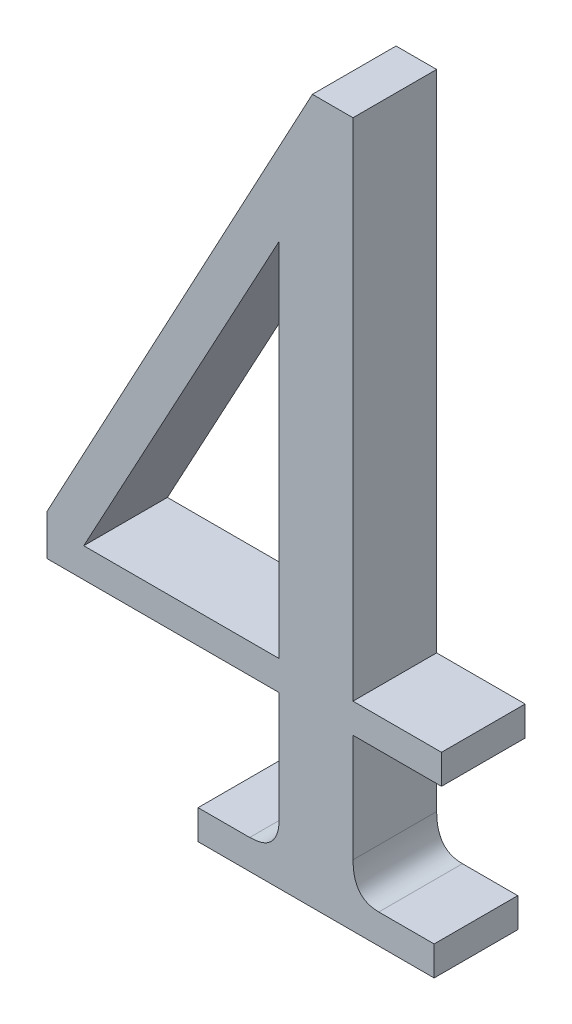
ISO-10303-21;
HEADER;
FILE_DESCRIPTION(('STEP AP214'),'2;1');
FILE_NAME('part.step','',(''),(''),'','','');
FILE_SCHEMA(('AUTOMOTIVE_DESIGN { 1 0 10303 214 1 1 1 1 }'));
ENDSEC;
DATA;
#1=APPLICATION_CONTEXT('core data for automotive mechanical design processes');
#2=APPLICATION_PROTOCOL_DEFINITION('international standard','automotive_design',2000,#1);
#3=PRODUCT_CONTEXT('',#1,'mechanical');
#4=PRODUCT('Part','Part','',(#3));
#5=PRODUCT_RELATED_PRODUCT_CATEGORY('part','',(#4));
#6=PRODUCT_DEFINITION_FORMATION('','',#4);
#7=PRODUCT_DEFINITION_CONTEXT('part definition',#1,'design');
#8=PRODUCT_DEFINITION('design','',#6,#7);
#9=PRODUCT_DEFINITION_SHAPE('','',#8);
#10=(LENGTH_UNIT() NAMED_UNIT(*) SI_UNIT(.MILLI.,.METRE.));
#11=(NAMED_UNIT(*) PLANE_ANGLE_UNIT() SI_UNIT($,.RADIAN.));
#12=(NAMED_UNIT(*) SI_UNIT($,.STERADIAN.) SOLID_ANGLE_UNIT());
#13=UNCERTAINTY_MEASURE_WITH_UNIT(LENGTH_MEASURE(1.E-05),#10,'distance_accuracy_value','');
#14=(GEOMETRIC_REPRESENTATION_CONTEXT(3) GLOBAL_UNCERTAINTY_ASSIGNED_CONTEXT((#13)) GLOBAL_UNIT_ASSIGNED_CONTEXT((#10,
#11,#12)) REPRESENTATION_CONTEXT('',''));
#15=CARTESIAN_POINT('',(0.,0.,0.));
#16=DIRECTION('',(0.,0.,1.));
#17=DIRECTION('',(1.,0.,0.));
#18=AXIS2_PLACEMENT_3D('',#15,#16,#17);
#19=CARTESIAN_POINT('',(12.4929833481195,0.0788718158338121,3.));
#20=DIRECTION('',(0.,0.,-1.));
#21=DIRECTION('',(-1.,0.,0.));
#22=AXIS2_PLACEMENT_3D('',#19,#20,#21);
#23=PLANE('',#22);
#24=DIRECTION('',(0.473315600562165,0.880892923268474,0.));
#25=VECTOR('',#24,1.);
#26=CARTESIAN_POINT('',(1.32275132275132,6.21693121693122,3.));
#27=LINE('',#26,#25);
#28=CARTESIAN_POINT('',(1.32275132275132,6.21693121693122,3.));
#29=VERTEX_POINT('',#28);
#30=CARTESIAN_POINT('',(10.8465608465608,23.9417989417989,3.));
#31=VERTEX_POINT('',#30);
#32=EDGE_CURVE('E214',#29,#31,#27,.T.);
#33=ORIENTED_EDGE('',*,*,#32,.F.);
#34=DIRECTION('',(0.,1.,0.));
#35=VECTOR('',#34,1.);
#36=CARTESIAN_POINT('',(1.32275132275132,4.76190476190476,3.));
#37=LINE('',#36,#35);
#38=CARTESIAN_POINT('',(1.32275132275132,4.76190476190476,3.));
#39=VERTEX_POINT('',#38);
#40=EDGE_CURVE('E342',#39,#29,#37,.T.);
#41=ORIENTED_EDGE('',*,*,#40,.F.);
#42=DIRECTION('',(-1.,0.,0.));
#43=VECTOR('',#42,1.);
#44=CARTESIAN_POINT('',(9.65608465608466,4.76190476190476,3.));
#45=LINE('',#44,#43);
#46=CARTESIAN_POINT('',(9.65608465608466,4.76190476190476,3.));
#47=VERTEX_POINT('',#46);
#48=EDGE_CURVE('E338',#47,#39,#45,.T.);
#49=ORIENTED_EDGE('',*,*,#48,.F.);
#50=DIRECTION('',(0.,1.,0.));
#51=VECTOR('',#50,1.);
#52=CARTESIAN_POINT('',(9.65608465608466,0.891632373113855,3.));
#53=LINE('',#52,#51);
#54=CARTESIAN_POINT('',(9.65608465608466,0.891632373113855,3.));
#55=VERTEX_POINT('',#54);
#56=EDGE_CURVE('E329',#55,#47,#53,.T.);
#57=ORIENTED_EDGE('',*,*,#56,.F.);
#58=CARTESIAN_POINT('',(8.5978835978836,-0.264550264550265,3.));
#59=CARTESIAN_POINT('',(8.68153222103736,-0.260950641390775,3.));
#60=CARTESIAN_POINT('',(8.83934158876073,-0.254159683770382,3.));
#61=CARTESIAN_POINT('',(9.05888298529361,-0.199812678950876,3.));
#62=CARTESIAN_POINT('',(9.24795517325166,-0.112378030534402,3.));
#63=CARTESIAN_POINT('',(9.39790454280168,0.021250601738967,3.));
#64=CARTESIAN_POINT('',(9.51990175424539,0.186883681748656,3.));
#65=CARTESIAN_POINT('',(9.60093788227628,0.392565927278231,3.));
#66=CARTESIAN_POINT('',(9.65020189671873,0.631258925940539,3.));
#67=CARTESIAN_POINT('',(9.6540491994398,0.801542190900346,3.));
#68=CARTESIAN_POINT('',(9.65608465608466,0.891632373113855,3.));
#69=B_SPLINE_CURVE_WITH_KNOTS('',3,(#58,#59,#60,#61,#62,#63,#64,#65,#66,#67,#68),.UNSPECIFIED.,
.F.,.F.,(4,1,1,1,1,1,1,1,4),(0.,0.139521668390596,0.263218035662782,0.375437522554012,
0.483709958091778,0.594997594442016,0.716049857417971,0.84977314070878,1.),.UNSPECIFIED.);
#70=CARTESIAN_POINT('',(8.5978835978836,-0.264550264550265,3.));
#71=VERTEX_POINT('',#70);
#72=EDGE_CURVE('E321',#71,#55,#69,.T.);
#73=ORIENTED_EDGE('',*,*,#72,.F.);
#74=DIRECTION('',(1.,0.,0.));
#75=VECTOR('',#74,1.);
#76=CARTESIAN_POINT('',(6.74603174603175,-0.264550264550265,3.));
#77=LINE('',#76,#75);
#78=CARTESIAN_POINT('',(6.74603174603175,-0.264550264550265,3.));
#79=VERTEX_POINT('',#78);
#80=EDGE_CURVE('E330',#79,#71,#77,.T.);
#81=ORIENTED_EDGE('',*,*,#80,.F.);
#82=DIRECTION('',(0.,1.,0.));
#83=VECTOR('',#82,1.);
#84=CARTESIAN_POINT('',(6.74603174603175,-1.32275132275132,3.));
#85=LINE('',#84,#83);
#86=CARTESIAN_POINT('',(6.74603174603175,-1.32275132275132,3.));
#87=VERTEX_POINT('',#86);
#88=EDGE_CURVE('E514',#87,#79,#85,.T.);
#89=ORIENTED_EDGE('',*,*,#88,.F.);
#90=DIRECTION('',(-1.,0.,0.));
#91=VECTOR('',#90,1.);
#92=CARTESIAN_POINT('',(15.2116402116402,-1.32275132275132,3.));
#93=LINE('',#92,#91);
#94=CARTESIAN_POINT('',(15.2116402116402,-1.32275132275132,3.));
#95=VERTEX_POINT('',#94);
#96=EDGE_CURVE('E501',#95,#87,#93,.T.);
#97=ORIENTED_EDGE('',*,*,#96,.F.);
#98=DIRECTION('',(0.,-1.,0.));
#99=VECTOR('',#98,1.);
#100=CARTESIAN_POINT('',(15.2116402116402,-0.264550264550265,3.));
#101=LINE('',#100,#99);
#102=CARTESIAN_POINT('',(15.2116402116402,-0.264550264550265,3.));
#103=VERTEX_POINT('',#102);
#104=EDGE_CURVE('E495',#103,#95,#101,.T.);
#105=ORIENTED_EDGE('',*,*,#104,.F.);
#106=DIRECTION('',(1.,0.,0.));
#107=VECTOR('',#106,1.);
#108=CARTESIAN_POINT('',(13.2275132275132,-0.264550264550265,3.));
#109=LINE('',#108,#107);
#110=CARTESIAN_POINT('',(13.2275132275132,-0.264550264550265,3.));
#111=VERTEX_POINT('',#110);
#112=EDGE_CURVE('E250',#111,#103,#109,.T.);
#113=ORIENTED_EDGE('',*,*,#112,.F.);
#114=CARTESIAN_POINT('',(12.3015873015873,0.891632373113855,3.));
#115=CARTESIAN_POINT('',(12.304057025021,0.801626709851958,3.));
#116=CARTESIAN_POINT('',(12.3087164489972,0.63182043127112,3.));
#117=CARTESIAN_POINT('',(12.3521720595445,0.393544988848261,3.));
#118=CARTESIAN_POINT('',(12.4247251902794,0.191273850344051,3.));
#119=CARTESIAN_POINT('',(12.5237023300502,0.0205479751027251,3.));
#120=CARTESIAN_POINT('',(12.6585932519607,-0.108459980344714,3.));
#121=CARTESIAN_POINT('',(12.8237090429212,-0.200554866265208,3.));
#122=CARTESIAN_POINT('',(13.0169657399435,-0.253258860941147,3.));
#123=CARTESIAN_POINT('',(13.1553378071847,-0.260679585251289,3.));
#124=CARTESIAN_POINT('',(13.2275132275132,-0.264550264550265,3.));
#125=B_SPLINE_CURVE_WITH_KNOTS('',3,(#114,#115,#116,#117,#118,#119,#120,#121,#122,#123,#124),
.UNSPECIFIED.,.F.,.F.,(4,1,1,1,1,1,1,1,4),(0.,0.159627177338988,0.301155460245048,
0.427675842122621,0.539502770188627,0.648129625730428,0.75453020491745,0.871961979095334,1.),.UNSPECIFIED.);
#126=CARTESIAN_POINT('',(12.3015873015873,0.891632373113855,3.));
#127=VERTEX_POINT('',#126);
#128=EDGE_CURVE('E243',#127,#111,#125,.T.);
#129=ORIENTED_EDGE('',*,*,#128,.F.);
#130=DIRECTION('',(0.,-1.,0.));
#131=VECTOR('',#130,1.);
#132=CARTESIAN_POINT('',(12.3015873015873,4.76190476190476,3.));
#133=LINE('',#132,#131);
#134=CARTESIAN_POINT('',(12.3015873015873,4.76190476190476,3.));
#135=VERTEX_POINT('',#134);
#136=EDGE_CURVE('E239',#135,#127,#133,.T.);
#137=ORIENTED_EDGE('',*,*,#136,.F.);
#138=DIRECTION('',(-1.,0.,0.));
#139=VECTOR('',#138,1.);
#140=CARTESIAN_POINT('',(15.4761904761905,4.76190476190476,3.));
#141=LINE('',#140,#139);
#142=CARTESIAN_POINT('',(15.4761904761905,4.76190476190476,3.));
#143=VERTEX_POINT('',#142);
#144=EDGE_CURVE('E235',#143,#135,#141,.T.);
#145=ORIENTED_EDGE('',*,*,#144,.F.);
#146=DIRECTION('',(0.,-1.,0.));
#147=VECTOR('',#146,1.);
#148=CARTESIAN_POINT('',(15.4761904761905,5.82010582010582,3.));
#149=LINE('',#148,#147);
#150=CARTESIAN_POINT('',(15.4761904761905,5.82010582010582,3.));
#151=VERTEX_POINT('',#150);
#152=EDGE_CURVE('E231',#151,#143,#149,.T.);
#153=ORIENTED_EDGE('',*,*,#152,.F.);
#154=DIRECTION('',(1.,0.,0.));
#155=VECTOR('',#154,1.);
#156=CARTESIAN_POINT('',(12.3015873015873,5.82010582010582,3.));
#157=LINE('',#156,#155);
#158=CARTESIAN_POINT('',(12.3015873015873,5.82010582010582,3.));
#159=VERTEX_POINT('',#158);
#160=EDGE_CURVE('E227',#159,#151,#157,.T.);
#161=ORIENTED_EDGE('',*,*,#160,.F.);
#162=DIRECTION('',(0.,-1.,0.));
#163=VECTOR('',#162,1.);
#164=CARTESIAN_POINT('',(12.3015873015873,23.9417989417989,3.));
#165=LINE('',#164,#163);
#166=CARTESIAN_POINT('',(12.3015873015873,23.9417989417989,3.));
#167=VERTEX_POINT('',#166);
#168=EDGE_CURVE('E223',#167,#159,#165,.T.);
#169=ORIENTED_EDGE('',*,*,#168,.F.);
#170=DIRECTION('',(1.,0.,0.));
#171=VECTOR('',#170,1.);
#172=CARTESIAN_POINT('',(10.8465608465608,23.9417989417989,3.));
#173=LINE('',#172,#171);
#174=EDGE_CURVE('E218',#31,#167,#173,.T.);
#175=ORIENTED_EDGE('',*,*,#174,.F.);
#176=EDGE_LOOP('',(#33,#41,#49,#57,#73,#81,#89,#97,#105,#113,#129,#137,#145,#153,#161,#169,#175));
#177=FACE_BOUND('',#176,.T.);
#178=DIRECTION('',(1.,0.,0.));
#179=VECTOR('',#178,1.);
#180=CARTESIAN_POINT('',(2.64550264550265,5.82010582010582,3.));
#181=LINE('',#180,#179);
#182=CARTESIAN_POINT('',(2.64550264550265,5.82010582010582,3.));
#183=VERTEX_POINT('',#182);
#184=CARTESIAN_POINT('',(9.65608465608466,5.82010582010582,3.));
#185=VERTEX_POINT('',#184);
#186=EDGE_CURVE('E178',#183,#185,#181,.T.);
#187=ORIENTED_EDGE('',*,*,#186,.F.);
#188=DIRECTION('',(-0.475704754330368,-0.879605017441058,0.));
#189=VECTOR('',#188,1.);
#190=CARTESIAN_POINT('',(9.65608465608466,18.7830687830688,3.));
#191=LINE('',#190,#189);
#192=CARTESIAN_POINT('',(9.65608465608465,18.7830687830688,3.));
#193=VERTEX_POINT('',#192);
#194=EDGE_CURVE('E197',#193,#183,#191,.T.);
#195=ORIENTED_EDGE('',*,*,#194,.F.);
#196=DIRECTION('',(0.,1.,0.));
#197=VECTOR('',#196,1.);
#198=CARTESIAN_POINT('',(9.65608465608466,5.82010582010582,3.));
#199=LINE('',#198,#197);
#200=EDGE_CURVE('E187',#185,#193,#199,.T.);
#201=ORIENTED_EDGE('',*,*,#200,.F.);
#202=EDGE_LOOP('',(#187,#195,#201));
#203=FACE_BOUND('',#202,.T.);
#204=ADVANCED_FACE('F39',(#177,#203),#23,.F.);
#205=CARTESIAN_POINT('',(12.4929833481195,0.0788718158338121,0.));
#206=DIRECTION('',(0.,0.,-1.));
#207=DIRECTION('',(-1.,0.,0.));
#208=AXIS2_PLACEMENT_3D('',#205,#206,#207);
#209=PLANE('',#208);
#210=DIRECTION('',(0.473315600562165,0.880892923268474,0.));
#211=VECTOR('',#210,1.);
#212=CARTESIAN_POINT('',(1.32275132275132,6.21693121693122,0.));
#213=LINE('',#212,#211);
#214=CARTESIAN_POINT('',(1.32275132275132,6.21693121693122,0.));
#215=VERTEX_POINT('',#214);
#216=CARTESIAN_POINT('',(10.8465608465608,23.9417989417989,0.));
#217=VERTEX_POINT('',#216);
#218=EDGE_CURVE('E195',#215,#217,#213,.T.);
#219=ORIENTED_EDGE('',*,*,#218,.T.);
#220=DIRECTION('',(1.,0.,0.));
#221=VECTOR('',#220,1.);
#222=CARTESIAN_POINT('',(10.8465608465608,23.9417989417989,0.));
#223=LINE('',#222,#221);
#224=CARTESIAN_POINT('',(12.3015873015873,23.9417989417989,0.));
#225=VERTEX_POINT('',#224);
#226=EDGE_CURVE('E349',#217,#225,#223,.T.);
#227=ORIENTED_EDGE('',*,*,#226,.T.);
#228=DIRECTION('',(0.,-1.,0.));
#229=VECTOR('',#228,1.);
#230=CARTESIAN_POINT('',(12.3015873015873,23.9417989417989,0.));
#231=LINE('',#230,#229);
#232=CARTESIAN_POINT('',(12.3015873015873,5.82010582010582,0.));
#233=VERTEX_POINT('',#232);
#234=EDGE_CURVE('E353',#225,#233,#231,.T.);
#235=ORIENTED_EDGE('',*,*,#234,.T.);
#236=DIRECTION('',(1.,0.,0.));
#237=VECTOR('',#236,1.);
#238=CARTESIAN_POINT('',(12.3015873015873,5.82010582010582,0.));
#239=LINE('',#238,#237);
#240=CARTESIAN_POINT('',(15.4761904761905,5.82010582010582,0.));
#241=VERTEX_POINT('',#240);
#242=EDGE_CURVE('E357',#233,#241,#239,.T.);
#243=ORIENTED_EDGE('',*,*,#242,.T.);
#244=DIRECTION('',(0.,-1.,0.));
#245=VECTOR('',#244,1.);
#246=CARTESIAN_POINT('',(15.4761904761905,5.82010582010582,0.));
#247=LINE('',#246,#245);
#248=CARTESIAN_POINT('',(15.4761904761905,4.76190476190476,0.));
#249=VERTEX_POINT('',#248);
#250=EDGE_CURVE('E361',#241,#249,#247,.T.);
#251=ORIENTED_EDGE('',*,*,#250,.T.);
#252=DIRECTION('',(-1.,0.,0.));
#253=VECTOR('',#252,1.);
#254=CARTESIAN_POINT('',(15.4761904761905,4.76190476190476,0.));
#255=LINE('',#254,#253);
#256=CARTESIAN_POINT('',(12.3015873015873,4.76190476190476,0.));
#257=VERTEX_POINT('',#256);
#258=EDGE_CURVE('E365',#249,#257,#255,.T.);
#259=ORIENTED_EDGE('',*,*,#258,.T.);
#260=DIRECTION('',(0.,-1.,0.));
#261=VECTOR('',#260,1.);
#262=CARTESIAN_POINT('',(12.3015873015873,4.76190476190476,0.));
#263=LINE('',#262,#261);
#264=CARTESIAN_POINT('',(12.3015873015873,0.891632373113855,0.));
#265=VERTEX_POINT('',#264);
#266=EDGE_CURVE('E369',#257,#265,#263,.T.);
#267=ORIENTED_EDGE('',*,*,#266,.T.);
#268=CARTESIAN_POINT('',(12.3015873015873,0.891632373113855,0.));
#269=CARTESIAN_POINT('',(12.304057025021,0.801626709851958,0.));
#270=CARTESIAN_POINT('',(12.3087164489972,0.63182043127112,0.));
#271=CARTESIAN_POINT('',(12.3521720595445,0.393544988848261,0.));
#272=CARTESIAN_POINT('',(12.4247251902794,0.191273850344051,0.));
#273=CARTESIAN_POINT('',(12.5237023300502,0.0205479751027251,0.));
#274=CARTESIAN_POINT('',(12.6585932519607,-0.108459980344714,0.));
#275=CARTESIAN_POINT('',(12.8237090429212,-0.200554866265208,0.));
#276=CARTESIAN_POINT('',(13.0169657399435,-0.253258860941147,0.));
#277=CARTESIAN_POINT('',(13.1553378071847,-0.260679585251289,0.));
#278=CARTESIAN_POINT('',(13.2275132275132,-0.264550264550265,0.));
#279=B_SPLINE_CURVE_WITH_KNOTS('',3,(#268,#269,#270,#271,#272,#273,#274,#275,#276,#277,#278),
.UNSPECIFIED.,.F.,.F.,(4,1,1,1,1,1,1,1,4),(0.,0.159627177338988,0.301155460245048,
0.427675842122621,0.539502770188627,0.648129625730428,0.75453020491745,0.871961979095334,1.),.UNSPECIFIED.);
#280=CARTESIAN_POINT('',(13.2275132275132,-0.264550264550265,0.));
#281=VERTEX_POINT('',#280);
#282=EDGE_CURVE('E373',#265,#281,#279,.T.);
#283=ORIENTED_EDGE('',*,*,#282,.T.);
#284=DIRECTION('',(1.,0.,0.));
#285=VECTOR('',#284,1.);
#286=CARTESIAN_POINT('',(13.2275132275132,-0.264550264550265,0.));
#287=LINE('',#286,#285);
#288=CARTESIAN_POINT('',(15.2116402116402,-0.264550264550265,0.));
#289=VERTEX_POINT('',#288);
#290=EDGE_CURVE('E379',#281,#289,#287,.T.);
#291=ORIENTED_EDGE('',*,*,#290,.T.);
#292=DIRECTION('',(0.,-1.,0.));
#293=VECTOR('',#292,1.);
#294=CARTESIAN_POINT('',(15.2116402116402,-0.264550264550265,0.));
#295=LINE('',#294,#293);
#296=CARTESIAN_POINT('',(15.2116402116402,-1.32275132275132,0.));
#297=VERTEX_POINT('',#296);
#298=EDGE_CURVE('E386',#289,#297,#295,.T.);
#299=ORIENTED_EDGE('',*,*,#298,.T.);
#300=DIRECTION('',(-1.,0.,0.));
#301=VECTOR('',#300,1.);
#302=CARTESIAN_POINT('',(15.2116402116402,-1.32275132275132,0.));
#303=LINE('',#302,#301);
#304=CARTESIAN_POINT('',(6.74603174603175,-1.32275132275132,0.));
#305=VERTEX_POINT('',#304);
#306=EDGE_CURVE('E390',#297,#305,#303,.T.);
#307=ORIENTED_EDGE('',*,*,#306,.T.);
#308=DIRECTION('',(0.,1.,0.));
#309=VECTOR('',#308,1.);
#310=CARTESIAN_POINT('',(6.74603174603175,-1.32275132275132,0.));
#311=LINE('',#310,#309);
#312=CARTESIAN_POINT('',(6.74603174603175,-0.264550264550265,0.));
#313=VERTEX_POINT('',#312);
#314=EDGE_CURVE('E394',#305,#313,#311,.T.);
#315=ORIENTED_EDGE('',*,*,#314,.T.);
#316=DIRECTION('',(1.,0.,0.));
#317=VECTOR('',#316,1.);
#318=CARTESIAN_POINT('',(6.74603174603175,-0.264550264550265,0.));
#319=LINE('',#318,#317);
#320=CARTESIAN_POINT('',(8.5978835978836,-0.264550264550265,0.));
#321=VERTEX_POINT('',#320);
#322=EDGE_CURVE('E398',#313,#321,#319,.T.);
#323=ORIENTED_EDGE('',*,*,#322,.T.);
#324=CARTESIAN_POINT('',(8.5978835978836,-0.264550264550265,0.));
#325=CARTESIAN_POINT('',(8.68153222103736,-0.260950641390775,0.));
#326=CARTESIAN_POINT('',(8.83934158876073,-0.254159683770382,0.));
#327=CARTESIAN_POINT('',(9.05888298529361,-0.199812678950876,0.));
#328=CARTESIAN_POINT('',(9.24795517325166,-0.112378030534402,0.));
#329=CARTESIAN_POINT('',(9.39790454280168,0.021250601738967,0.));
#330=CARTESIAN_POINT('',(9.51990175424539,0.186883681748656,0.));
#331=CARTESIAN_POINT('',(9.60093788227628,0.392565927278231,0.));
#332=CARTESIAN_POINT('',(9.65020189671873,0.631258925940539,0.));
#333=CARTESIAN_POINT('',(9.6540491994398,0.801542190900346,0.));
#334=CARTESIAN_POINT('',(9.65608465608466,0.891632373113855,0.));
#335=B_SPLINE_CURVE_WITH_KNOTS('',3,(#324,#325,#326,#327,#328,#329,#330,#331,#332,#333,#334),
.UNSPECIFIED.,.F.,.F.,(4,1,1,1,1,1,1,1,4),(0.,0.139521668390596,0.263218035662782,
0.375437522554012,0.483709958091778,0.594997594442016,0.716049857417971,0.84977314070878,1.),.UNSPECIFIED.);
#336=CARTESIAN_POINT('',(9.65608465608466,0.891632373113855,0.));
#337=VERTEX_POINT('',#336);
#338=EDGE_CURVE('E402',#321,#337,#335,.T.);
#339=ORIENTED_EDGE('',*,*,#338,.T.);
#340=DIRECTION('',(0.,1.,0.));
#341=VECTOR('',#340,1.);
#342=CARTESIAN_POINT('',(9.65608465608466,0.891632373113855,0.));
#343=LINE('',#342,#341);
#344=CARTESIAN_POINT('',(9.65608465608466,4.76190476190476,0.));
#345=VERTEX_POINT('',#344);
#346=EDGE_CURVE('E408',#337,#345,#343,.T.);
#347=ORIENTED_EDGE('',*,*,#346,.T.);
#348=DIRECTION('',(-1.,0.,0.));
#349=VECTOR('',#348,1.);
#350=CARTESIAN_POINT('',(9.65608465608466,4.76190476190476,0.));
#351=LINE('',#350,#349);
#352=CARTESIAN_POINT('',(1.32275132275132,4.76190476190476,0.));
#353=VERTEX_POINT('',#352);
#354=EDGE_CURVE('E415',#345,#353,#351,.T.);
#355=ORIENTED_EDGE('',*,*,#354,.T.);
#356=DIRECTION('',(0.,1.,0.));
#357=VECTOR('',#356,1.);
#358=CARTESIAN_POINT('',(1.32275132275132,4.76190476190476,0.));
#359=LINE('',#358,#357);
#360=EDGE_CURVE('E219',#353,#215,#359,.T.);
#361=ORIENTED_EDGE('',*,*,#360,.T.);
#362=EDGE_LOOP('',(#219,#227,#235,#243,#251,#259,#267,#283,#291,#299,#307,#315,#323,#339,#347,
#355,#361));
#363=FACE_BOUND('',#362,.T.);
#364=DIRECTION('',(-0.475704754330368,-0.879605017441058,0.));
#365=VECTOR('',#364,1.);
#366=CARTESIAN_POINT('',(9.65608465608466,18.7830687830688,0.));
#367=LINE('',#366,#365);
#368=CARTESIAN_POINT('',(9.65608465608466,18.7830687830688,0.));
#369=VERTEX_POINT('',#368);
#370=CARTESIAN_POINT('',(2.64550264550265,5.82010582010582,0.));
#371=VERTEX_POINT('',#370);
#372=EDGE_CURVE('E188',#369,#371,#367,.T.);
#373=ORIENTED_EDGE('',*,*,#372,.T.);
#374=DIRECTION('',(1.,0.,0.));
#375=VECTOR('',#374,1.);
#376=CARTESIAN_POINT('',(2.64550264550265,5.82010582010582,0.));
#377=LINE('',#376,#375);
#378=CARTESIAN_POINT('',(9.65608465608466,5.82010582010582,0.));
#379=VERTEX_POINT('',#378);
#380=EDGE_CURVE('E65',#371,#379,#377,.T.);
#381=ORIENTED_EDGE('',*,*,#380,.T.);
#382=DIRECTION('',(0.,1.,0.));
#383=VECTOR('',#382,1.);
#384=CARTESIAN_POINT('',(9.65608465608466,5.82010582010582,0.));
#385=LINE('',#384,#383);
#386=EDGE_CURVE('E193',#379,#369,#385,.T.);
#387=ORIENTED_EDGE('',*,*,#386,.T.);
#388=EDGE_LOOP('',(#373,#381,#387));
#389=FACE_BOUND('',#388,.T.);
#390=ADVANCED_FACE('F291',(#363,#389),#209,.T.);
#391=CARTESIAN_POINT('',(1.32275132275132,6.21693121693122,3.));
#392=DIRECTION('',(-0.880892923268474,0.473315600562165,0.));
#393=DIRECTION('',(-0.473315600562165,-0.880892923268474,0.));
#394=AXIS2_PLACEMENT_3D('',#391,#392,#393);
#395=PLANE('',#394);
#396=ORIENTED_EDGE('',*,*,#218,.F.);
#397=DIRECTION('',(0.,0.,-1.));
#398=VECTOR('',#397,1.);
#399=CARTESIAN_POINT('',(1.32275132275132,6.21693121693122,3.));
#400=LINE('',#399,#398);
#401=EDGE_CURVE('E11',#29,#215,#400,.T.);
#402=ORIENTED_EDGE('',*,*,#401,.F.);
#403=ORIENTED_EDGE('',*,*,#32,.T.);
#404=DIRECTION('',(0.,0.,-1.));
#405=VECTOR('',#404,1.);
#406=CARTESIAN_POINT('',(10.8465608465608,23.9417989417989,3.));
#407=LINE('',#406,#405);
#408=EDGE_CURVE('E43',#31,#217,#407,.T.);
#409=ORIENTED_EDGE('',*,*,#408,.T.);
#410=EDGE_LOOP('',(#396,#402,#403,#409));
#411=FACE_BOUND('',#410,.T.);
#412=ADVANCED_FACE('F41',(#411),#395,.T.);
#413=CARTESIAN_POINT('',(1.32275132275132,4.76190476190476,3.));
#414=DIRECTION('',(-1.,0.,0.));
#415=DIRECTION('',(0.,0.,1.));
#416=AXIS2_PLACEMENT_3D('',#413,#414,#415);
#417=PLANE('',#416);
#418=ORIENTED_EDGE('',*,*,#360,.F.);
#419=DIRECTION('',(0.,0.,-1.));
#420=VECTOR('',#419,1.);
#421=CARTESIAN_POINT('',(1.32275132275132,4.76190476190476,3.));
#422=LINE('',#421,#420);
#423=EDGE_CURVE('E49',#39,#353,#422,.T.);
#424=ORIENTED_EDGE('',*,*,#423,.F.);
#425=ORIENTED_EDGE('',*,*,#40,.T.);
#426=ORIENTED_EDGE('',*,*,#401,.T.);
#427=EDGE_LOOP('',(#418,#424,#425,#426));
#428=FACE_BOUND('',#427,.T.);
#429=ADVANCED_FACE('F302',(#428),#417,.T.);
#430=CARTESIAN_POINT('',(9.65608465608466,4.76190476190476,3.));
#431=DIRECTION('',(0.,-1.,0.));
#432=DIRECTION('',(0.,0.,-1.));
#433=AXIS2_PLACEMENT_3D('',#430,#431,#432);
#434=PLANE('',#433);
#435=ORIENTED_EDGE('',*,*,#354,.F.);
#436=DIRECTION('',(0.,0.,-1.));
#437=VECTOR('',#436,1.);
#438=CARTESIAN_POINT('',(9.65608465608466,4.76190476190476,3.));
#439=LINE('',#438,#437);
#440=EDGE_CURVE('E424',#47,#345,#439,.T.);
#441=ORIENTED_EDGE('',*,*,#440,.F.);
#442=ORIENTED_EDGE('',*,*,#48,.T.);
#443=ORIENTED_EDGE('',*,*,#423,.T.);
#444=EDGE_LOOP('',(#435,#441,#442,#443));
#445=FACE_BOUND('',#444,.T.);
#446=ADVANCED_FACE('F305',(#445),#434,.T.);
#447=CARTESIAN_POINT('',(9.65608465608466,0.891632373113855,3.));
#448=DIRECTION('',(-1.,0.,0.));
#449=DIRECTION('',(0.,0.,1.));
#450=AXIS2_PLACEMENT_3D('',#447,#448,#449);
#451=PLANE('',#450);
#452=ORIENTED_EDGE('',*,*,#346,.F.);
#453=DIRECTION('',(0.,0.,-1.));
#454=VECTOR('',#453,1.);
#455=CARTESIAN_POINT('',(9.65608465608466,0.891632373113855,3.));
#456=LINE('',#455,#454);
#457=EDGE_CURVE('E427',#55,#337,#456,.T.);
#458=ORIENTED_EDGE('',*,*,#457,.F.);
#459=ORIENTED_EDGE('',*,*,#56,.T.);
#460=ORIENTED_EDGE('',*,*,#440,.T.);
#461=EDGE_LOOP('',(#452,#458,#459,#460));
#462=FACE_BOUND('',#461,.T.);
#463=ADVANCED_FACE('F309',(#462),#451,.T.);
#464=DIRECTION('',(0.,0.,-1.));
#465=VECTOR('',#464,1.);
#466=SURFACE_OF_LINEAR_EXTRUSION('',#69,#465);
#467=ORIENTED_EDGE('',*,*,#338,.F.);
#468=DIRECTION('',(0.,0.,-1.));
#469=VECTOR('',#468,1.);
#470=CARTESIAN_POINT('',(8.5978835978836,-0.264550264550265,3.));
#471=LINE('',#470,#469);
#472=EDGE_CURVE('E430',#71,#321,#471,.T.);
#473=ORIENTED_EDGE('',*,*,#472,.F.);
#474=ORIENTED_EDGE('',*,*,#72,.T.);
#475=ORIENTED_EDGE('',*,*,#457,.T.);
#476=EDGE_LOOP('',(#467,#473,#474,#475));
#477=FACE_BOUND('',#476,.T.);
#478=ADVANCED_FACE('F313',(#477),#466,.T.);
#479=CARTESIAN_POINT('',(6.74603174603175,-0.264550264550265,3.));
#480=DIRECTION('',(0.,1.,0.));
#481=DIRECTION('',(0.,0.,1.));
#482=AXIS2_PLACEMENT_3D('',#479,#480,#481);
#483=PLANE('',#482);
#484=ORIENTED_EDGE('',*,*,#322,.F.);
#485=DIRECTION('',(0.,0.,-1.));
#486=VECTOR('',#485,1.);
#487=CARTESIAN_POINT('',(6.74603174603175,-0.264550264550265,3.));
#488=LINE('',#487,#486);
#489=EDGE_CURVE('E433',#79,#313,#488,.T.);
#490=ORIENTED_EDGE('',*,*,#489,.F.);
#491=ORIENTED_EDGE('',*,*,#80,.T.);
#492=ORIENTED_EDGE('',*,*,#472,.T.);
#493=EDGE_LOOP('',(#484,#490,#491,#492));
#494=FACE_BOUND('',#493,.T.);
#495=ADVANCED_FACE('F318',(#494),#483,.T.);
#496=CARTESIAN_POINT('',(6.74603174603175,-1.32275132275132,3.));
#497=DIRECTION('',(-1.,0.,0.));
#498=DIRECTION('',(0.,0.,1.));
#499=AXIS2_PLACEMENT_3D('',#496,#497,#498);
#500=PLANE('',#499);
#501=ORIENTED_EDGE('',*,*,#314,.F.);
#502=DIRECTION('',(0.,0.,-1.));
#503=VECTOR('',#502,1.);
#504=CARTESIAN_POINT('',(6.74603174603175,-1.32275132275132,3.));
#505=LINE('',#504,#503);
#506=EDGE_CURVE('E436',#87,#305,#505,.T.);
#507=ORIENTED_EDGE('',*,*,#506,.F.);
#508=ORIENTED_EDGE('',*,*,#88,.T.);
#509=ORIENTED_EDGE('',*,*,#489,.T.);
#510=EDGE_LOOP('',(#501,#507,#508,#509));
#511=FACE_BOUND('',#510,.T.);
#512=ADVANCED_FACE('F505',(#511),#500,.T.);
#513=CARTESIAN_POINT('',(15.2116402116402,-1.32275132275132,3.));
#514=DIRECTION('',(0.,-1.,0.));
#515=DIRECTION('',(0.,0.,-1.));
#516=AXIS2_PLACEMENT_3D('',#513,#514,#515);
#517=PLANE('',#516);
#518=ORIENTED_EDGE('',*,*,#306,.F.);
#519=DIRECTION('',(0.,0.,-1.));
#520=VECTOR('',#519,1.);
#521=CARTESIAN_POINT('',(15.2116402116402,-1.32275132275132,3.));
#522=LINE('',#521,#520);
#523=EDGE_CURVE('E439',#95,#297,#522,.T.);
#524=ORIENTED_EDGE('',*,*,#523,.F.);
#525=ORIENTED_EDGE('',*,*,#96,.T.);
#526=ORIENTED_EDGE('',*,*,#506,.T.);
#527=EDGE_LOOP('',(#518,#524,#525,#526));
#528=FACE_BOUND('',#527,.T.);
#529=ADVANCED_FACE('F499',(#528),#517,.T.);
#530=CARTESIAN_POINT('',(15.2116402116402,-0.264550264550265,3.));
#531=DIRECTION('',(1.,0.,0.));
#532=DIRECTION('',(0.,0.,-1.));
#533=AXIS2_PLACEMENT_3D('',#530,#531,#532);
#534=PLANE('',#533);
#535=ORIENTED_EDGE('',*,*,#298,.F.);
#536=DIRECTION('',(0.,0.,-1.));
#537=VECTOR('',#536,1.);
#538=CARTESIAN_POINT('',(15.2116402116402,-0.264550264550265,3.));
#539=LINE('',#538,#537);
#540=EDGE_CURVE('E442',#103,#289,#539,.T.);
#541=ORIENTED_EDGE('',*,*,#540,.F.);
#542=ORIENTED_EDGE('',*,*,#104,.T.);
#543=ORIENTED_EDGE('',*,*,#523,.T.);
#544=EDGE_LOOP('',(#535,#541,#542,#543));
#545=FACE_BOUND('',#544,.T.);
#546=ADVANCED_FACE('F492',(#545),#534,.T.);
#547=CARTESIAN_POINT('',(13.2275132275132,-0.264550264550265,3.));
#548=DIRECTION('',(0.,1.,0.));
#549=DIRECTION('',(0.,0.,1.));
#550=AXIS2_PLACEMENT_3D('',#547,#548,#549);
#551=PLANE('',#550);
#552=ORIENTED_EDGE('',*,*,#290,.F.);
#553=DIRECTION('',(0.,0.,-1.));
#554=VECTOR('',#553,1.);
#555=CARTESIAN_POINT('',(13.2275132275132,-0.264550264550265,3.));
#556=LINE('',#555,#554);
#557=EDGE_CURVE('E445',#111,#281,#556,.T.);
#558=ORIENTED_EDGE('',*,*,#557,.F.);
#559=ORIENTED_EDGE('',*,*,#112,.T.);
#560=ORIENTED_EDGE('',*,*,#540,.T.);
#561=EDGE_LOOP('',(#552,#558,#559,#560));
#562=FACE_BOUND('',#561,.T.);
#563=ADVANCED_FACE('F261',(#562),#551,.T.);
#564=DIRECTION('',(0.,0.,-1.));
#565=VECTOR('',#564,1.);
#566=SURFACE_OF_LINEAR_EXTRUSION('',#125,#565);
#567=ORIENTED_EDGE('',*,*,#282,.F.);
#568=DIRECTION('',(0.,0.,-1.));
#569=VECTOR('',#568,1.);
#570=CARTESIAN_POINT('',(12.3015873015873,0.891632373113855,3.));
#571=LINE('',#570,#569);
#572=EDGE_CURVE('E448',#127,#265,#571,.T.);
#573=ORIENTED_EDGE('',*,*,#572,.F.);
#574=ORIENTED_EDGE('',*,*,#128,.T.);
#575=ORIENTED_EDGE('',*,*,#557,.T.);
#576=EDGE_LOOP('',(#567,#573,#574,#575));
#577=FACE_BOUND('',#576,.T.);
#578=ADVANCED_FACE('F256',(#577),#566,.T.);
#579=CARTESIAN_POINT('',(12.3015873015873,4.76190476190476,3.));
#580=DIRECTION('',(1.,0.,0.));
#581=DIRECTION('',(0.,0.,-1.));
#582=AXIS2_PLACEMENT_3D('',#579,#580,#581);
#583=PLANE('',#582);
#584=ORIENTED_EDGE('',*,*,#266,.F.);
#585=DIRECTION('',(0.,0.,-1.));
#586=VECTOR('',#585,1.);
#587=CARTESIAN_POINT('',(12.3015873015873,4.76190476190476,3.));
#588=LINE('',#587,#586);
#589=EDGE_CURVE('E451',#135,#257,#588,.T.);
#590=ORIENTED_EDGE('',*,*,#589,.F.);
#591=ORIENTED_EDGE('',*,*,#136,.T.);
#592=ORIENTED_EDGE('',*,*,#572,.T.);
#593=EDGE_LOOP('',(#584,#590,#591,#592));
#594=FACE_BOUND('',#593,.T.);
#595=ADVANCED_FACE('F260',(#594),#583,.T.);
#596=CARTESIAN_POINT('',(15.4761904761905,4.76190476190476,3.));
#597=DIRECTION('',(0.,-1.,0.));
#598=DIRECTION('',(0.,0.,-1.));
#599=AXIS2_PLACEMENT_3D('',#596,#597,#598);
#600=PLANE('',#599);
#601=ORIENTED_EDGE('',*,*,#258,.F.);
#602=DIRECTION('',(0.,0.,-1.));
#603=VECTOR('',#602,1.);
#604=CARTESIAN_POINT('',(15.4761904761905,4.76190476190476,3.));
#605=LINE('',#604,#603);
#606=EDGE_CURVE('E454',#143,#249,#605,.T.);
#607=ORIENTED_EDGE('',*,*,#606,.F.);
#608=ORIENTED_EDGE('',*,*,#144,.T.);
#609=ORIENTED_EDGE('',*,*,#589,.T.);
#610=EDGE_LOOP('',(#601,#607,#608,#609));
#611=FACE_BOUND('',#610,.T.);
#612=ADVANCED_FACE('F266',(#611),#600,.T.);
#613=CARTESIAN_POINT('',(15.4761904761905,5.82010582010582,3.));
#614=DIRECTION('',(1.,0.,0.));
#615=DIRECTION('',(0.,0.,-1.));
#616=AXIS2_PLACEMENT_3D('',#613,#614,#615);
#617=PLANE('',#616);
#618=ORIENTED_EDGE('',*,*,#250,.F.);
#619=DIRECTION('',(0.,0.,-1.));
#620=VECTOR('',#619,1.);
#621=CARTESIAN_POINT('',(15.4761904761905,5.82010582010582,3.));
#622=LINE('',#621,#620);
#623=EDGE_CURVE('E457',#151,#241,#622,.T.);
#624=ORIENTED_EDGE('',*,*,#623,.F.);
#625=ORIENTED_EDGE('',*,*,#152,.T.);
#626=ORIENTED_EDGE('',*,*,#606,.T.);
#627=EDGE_LOOP('',(#618,#624,#625,#626));
#628=FACE_BOUND('',#627,.T.);
#629=ADVANCED_FACE('F270',(#628),#617,.T.);
#630=CARTESIAN_POINT('',(12.3015873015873,5.82010582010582,3.));
#631=DIRECTION('',(0.,1.,0.));
#632=DIRECTION('',(0.,0.,1.));
#633=AXIS2_PLACEMENT_3D('',#630,#631,#632);
#634=PLANE('',#633);
#635=ORIENTED_EDGE('',*,*,#242,.F.);
#636=DIRECTION('',(0.,0.,-1.));
#637=VECTOR('',#636,1.);
#638=CARTESIAN_POINT('',(12.3015873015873,5.82010582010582,3.));
#639=LINE('',#638,#637);
#640=EDGE_CURVE('E460',#159,#233,#639,.T.);
#641=ORIENTED_EDGE('',*,*,#640,.F.);
#642=ORIENTED_EDGE('',*,*,#160,.T.);
#643=ORIENTED_EDGE('',*,*,#623,.T.);
#644=EDGE_LOOP('',(#635,#641,#642,#643));
#645=FACE_BOUND('',#644,.T.);
#646=ADVANCED_FACE('F274',(#645),#634,.T.);
#647=CARTESIAN_POINT('',(12.3015873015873,23.9417989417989,3.));
#648=DIRECTION('',(1.,0.,0.));
#649=DIRECTION('',(0.,0.,-1.));
#650=AXIS2_PLACEMENT_3D('',#647,#648,#649);
#651=PLANE('',#650);
#652=ORIENTED_EDGE('',*,*,#234,.F.);
#653=DIRECTION('',(0.,0.,-1.));
#654=VECTOR('',#653,1.);
#655=CARTESIAN_POINT('',(12.3015873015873,23.9417989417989,3.));
#656=LINE('',#655,#654);
#657=EDGE_CURVE('E462',#167,#225,#656,.T.);
#658=ORIENTED_EDGE('',*,*,#657,.F.);
#659=ORIENTED_EDGE('',*,*,#168,.T.);
#660=ORIENTED_EDGE('',*,*,#640,.T.);
#661=EDGE_LOOP('',(#652,#658,#659,#660));
#662=FACE_BOUND('',#661,.T.);
#663=ADVANCED_FACE('F278',(#662),#651,.T.);
#664=CARTESIAN_POINT('',(10.8465608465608,23.9417989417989,3.));
#665=DIRECTION('',(0.,1.,0.));
#666=DIRECTION('',(0.,0.,1.));
#667=AXIS2_PLACEMENT_3D('',#664,#665,#666);
#668=PLANE('',#667);
#669=ORIENTED_EDGE('',*,*,#226,.F.);
#670=ORIENTED_EDGE('',*,*,#408,.F.);
#671=ORIENTED_EDGE('',*,*,#174,.T.);
#672=ORIENTED_EDGE('',*,*,#657,.T.);
#673=EDGE_LOOP('',(#669,#670,#671,#672));
#674=FACE_BOUND('',#673,.T.);
#675=ADVANCED_FACE('F281',(#674),#668,.T.);
#676=CARTESIAN_POINT('',(2.64550264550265,5.82010582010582,3.));
#677=DIRECTION('',(0.,1.,0.));
#678=DIRECTION('',(0.,0.,1.));
#679=AXIS2_PLACEMENT_3D('',#676,#677,#678);
#680=PLANE('',#679);
#681=ORIENTED_EDGE('',*,*,#380,.F.);
#682=DIRECTION('',(0.,0.,-1.));
#683=VECTOR('',#682,1.);
#684=CARTESIAN_POINT('',(2.64550264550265,5.82010582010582,3.));
#685=LINE('',#684,#683);
#686=EDGE_CURVE('E182',#183,#371,#685,.T.);
#687=ORIENTED_EDGE('',*,*,#686,.F.);
#688=ORIENTED_EDGE('',*,*,#186,.T.);
#689=DIRECTION('',(0.,0.,-1.));
#690=VECTOR('',#689,1.);
#691=CARTESIAN_POINT('',(9.65608465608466,5.82010582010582,3.));
#692=LINE('',#691,#690);
#693=EDGE_CURVE('E181',#185,#379,#692,.T.);
#694=ORIENTED_EDGE('',*,*,#693,.T.);
#695=EDGE_LOOP('',(#681,#687,#688,#694));
#696=FACE_BOUND('',#695,.T.);
#697=ADVANCED_FACE('F180',(#696),#680,.T.);
#698=CARTESIAN_POINT('',(9.65608465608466,5.82010582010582,3.));
#699=DIRECTION('',(-1.,0.,0.));
#700=DIRECTION('',(0.,0.,1.));
#701=AXIS2_PLACEMENT_3D('',#698,#699,#700);
#702=PLANE('',#701);
#703=ORIENTED_EDGE('',*,*,#386,.F.);
#704=ORIENTED_EDGE('',*,*,#693,.F.);
#705=ORIENTED_EDGE('',*,*,#200,.T.);
#706=DIRECTION('',(0.,0.,-1.));
#707=VECTOR('',#706,1.);
#708=CARTESIAN_POINT('',(9.65608465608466,18.7830687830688,3.));
#709=LINE('',#708,#707);
#710=EDGE_CURVE('E57',#193,#369,#709,.T.);
#711=ORIENTED_EDGE('',*,*,#710,.T.);
#712=EDGE_LOOP('',(#703,#704,#705,#711));
#713=FACE_BOUND('',#712,.T.);
#714=ADVANCED_FACE('F191',(#713),#702,.T.);
#715=CARTESIAN_POINT('',(9.65608465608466,18.7830687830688,3.));
#716=DIRECTION('',(0.879605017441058,-0.475704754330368,0.));
#717=DIRECTION('',(0.475704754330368,0.879605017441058,0.));
#718=AXIS2_PLACEMENT_3D('',#715,#716,#717);
#719=PLANE('',#718);
#720=ORIENTED_EDGE('',*,*,#372,.F.);
#721=ORIENTED_EDGE('',*,*,#710,.F.);
#722=ORIENTED_EDGE('',*,*,#194,.T.);
#723=ORIENTED_EDGE('',*,*,#686,.T.);
#724=EDGE_LOOP('',(#720,#721,#722,#723));
#725=FACE_BOUND('',#724,.T.);
#726=ADVANCED_FACE('F578',(#725),#719,.T.);
#727=CLOSED_SHELL('',(#204,#390,#412,#429,#446,#463,#478,#495,#512,#529,#546,#563,#578,#595,
#612,#629,#646,#663,#675,#697,#714,#726));
#728=MANIFOLD_SOLID_BREP('B2',#727);
#729=ADVANCED_BREP_SHAPE_REPRESENTATION('',(#18,#728),#14);
#730=SHAPE_DEFINITION_REPRESENTATION(#9,#729);
ENDSEC;
END-ISO-10303-21;
